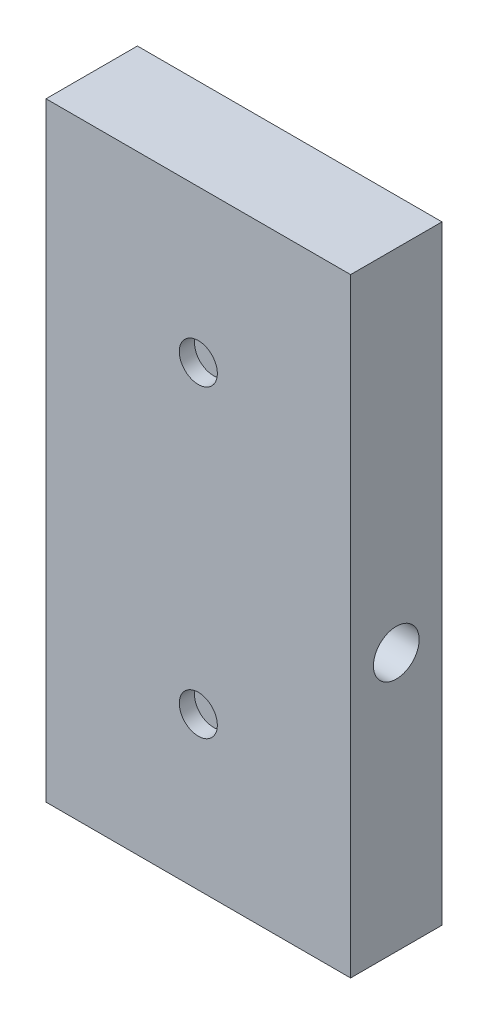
from build123d import *

# Parameters (mm, degrees)
ESQUISSE1_W             = 20
ESQUISSE1_H             = 40
EXTRUSION1_DEPTH        = 6
ESQUISSE2_R             = 1.5
ENL_V_MAT_EXTRU_1_DEPTH = 10
ESQUISSE3_R             = 1.25
ENL_V_MAT_EXTRU_2_DEPTH = 1
ESQUISSE4_R             = 1.25
ENL_V_MAT_EXTRU_3_DEPTH = 1
ESQUISSE5_R             = 1
ENL_V_MAT_EXTRU_4_DEPTH = 2


with BuildPart() as part:
    # Esquisse1 → Extrusion1 (new body)
    with BuildSketch(Plane.XY):
        with Locations((-26.681116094, 14.531307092)):
            Rectangle(ESQUISSE1_W, ESQUISSE1_H)
    extrude(amount=EXTRUSION1_DEPTH)

    # Esquisse2 → Enl_v. mat.-Extru.1 (cut)
    with BuildSketch(Plane(origin=(-16.681116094, 0, 0), x_dir=(0, 0, -1), z_dir=(1, 0, 0))):
        with Locations(Location((-3, 11.531307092, 0), (0, 0, 90))):
            Circle(ESQUISSE2_R)
    extrude(amount=-ENL_V_MAT_EXTRU_1_DEPTH, mode=Mode.SUBTRACT)

    # Esquisse3 → Enl_v. mat.-Extru.2 (cut)
    with BuildSketch(Plane(origin=(0, 0, 0), x_dir=(-1, 0, 0), z_dir=(0, 0, -1))):
        with Locations((26.681116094, -2.468692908)):
            Circle(ESQUISSE3_R)
        with Locations((26.681116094, 31.531307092)):
            Circle(ESQUISSE3_R)
    extrude(amount=-ENL_V_MAT_EXTRU_2_DEPTH, mode=Mode.SUBTRACT)

    # Esquisse4 → Enl_v. mat.-Extru.3 (cut)
    with BuildSketch(Plane.XY.offset(6)):
        with Locations((-26.681116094, 4.531307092)):
            Circle(ESQUISSE4_R)
        with Locations((-26.681116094, 24.531307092)):
            Circle(ESQUISSE4_R)
    extrude(amount=-ENL_V_MAT_EXTRU_3_DEPTH, mode=Mode.SUBTRACT)

    # Esquisse5 → Enl_v. mat.-Extru.4 (cut)
    with BuildSketch(Plane(origin=(0, 0, 0), x_dir=(-1, 0, 0), z_dir=(0, 0, -1))):
        with Locations((21.681116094, 11.531307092)):
            Circle(ESQUISSE5_R)
    extrude(amount=-ENL_V_MAT_EXTRU_4_DEPTH, mode=Mode.SUBTRACT)


solid = part.part
